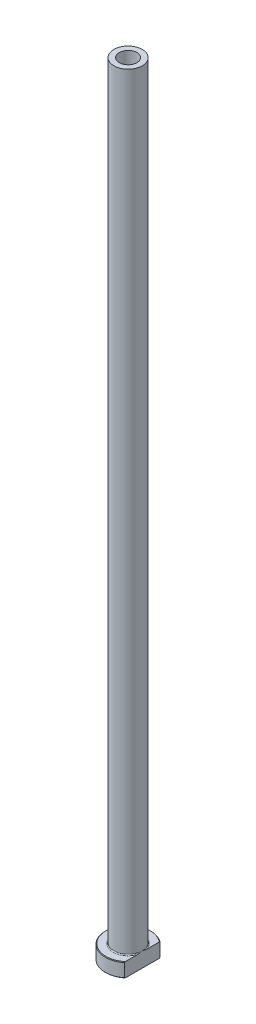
from build123d import *

# Parameters (mm, degrees)
FILLET1_R          = 0.3
CHAMFER1_SIZE      = 0.2
CUT_EXTRUDE1_DEPTH = 276.23262888
CHAMFER2_SIZE      = 0.5


with BuildPart() as part:
    # Sketch1 → Revolve1 (revolve)
    with BuildSketch(Plane.XY, mode=Mode.PRIVATE) as revolve1_sk:
        Polygon((-3.1, 275), (-5, 275), (-5, 5), (-8, 5), (-8, 0), (-3.35, 0), (-3.35, 218), (-3.1, 230), align=None)
    revolve(revolve1_sk.sketch.rotate(Axis((0, 92.187680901, 0), (0, -1, 0)), 270), axis=Axis((0, 92.187680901, 0), (0, -1, 0)))

    # Fillet1
    fillet1_edges = [part.edges().sort_by_distance(p)[0] for p in [
        (0, 5, -5),
    ]]
    fillet(fillet1_edges, radius=FILLET1_R)

    # Chamfer1
    chamfer1_edges = [part.edges().sort_by_distance(p)[0] for p in [
        (0, 0, -8),
        (0, 5, -8),
    ]]
    chamfer(chamfer1_edges, length=CHAMFER1_SIZE)

    # Sketch2 → Cut-Extrude1 (cut, through all)
    with BuildSketch(Plane.XZ):
        with BuildLine():
            Line((5, 6.244997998), (5, -6.244997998))
            ThreePointArc((5, -6.244997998), (8, 0), (5, 6.244997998))
        make_face()
    extrude(amount=-CUT_EXTRUDE1_DEPTH, mode=Mode.SUBTRACT)

    # Chamfer2
    chamfer2_edges = [part.edges().sort_by_distance(p)[0] for p in [
        (0, 0, -3.35),
    ]]
    chamfer(chamfer2_edges, length=CHAMFER2_SIZE)


solid = part.part
